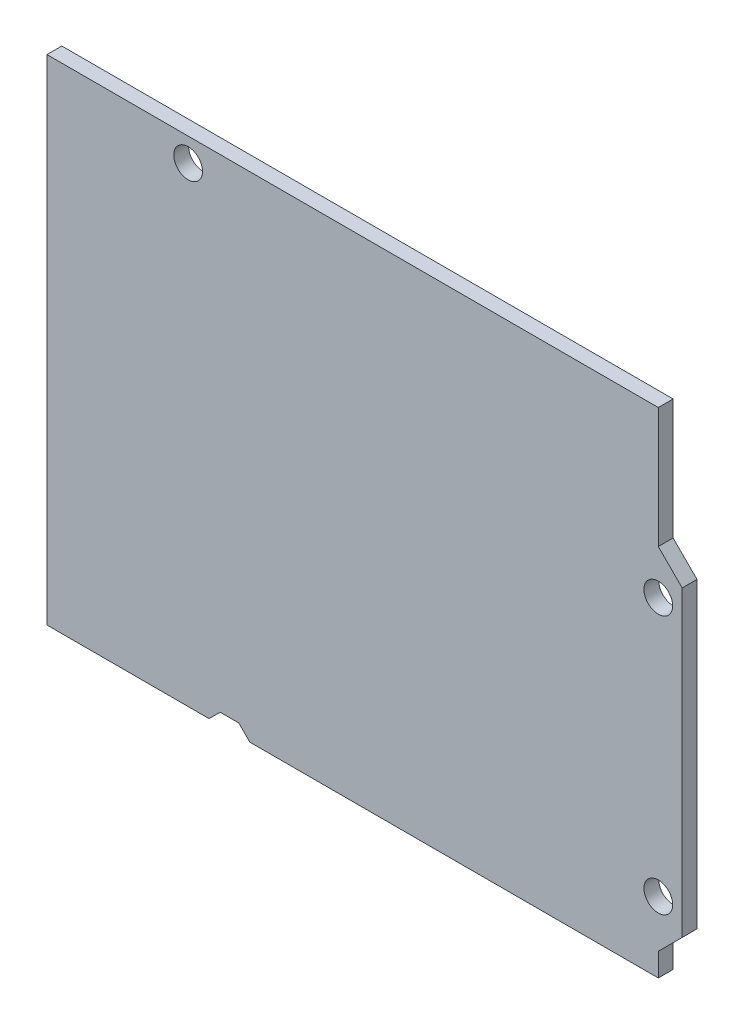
ISO-10303-21;
HEADER;
FILE_DESCRIPTION(('STEP AP214'),'2;1');
FILE_NAME('part.step','',(''),(''),'','','');
FILE_SCHEMA(('AUTOMOTIVE_DESIGN { 1 0 10303 214 1 1 1 1 }'));
ENDSEC;
DATA;
#1=APPLICATION_CONTEXT('core data for automotive mechanical design processes');
#2=APPLICATION_PROTOCOL_DEFINITION('international standard','automotive_design',2000,#1);
#3=PRODUCT_CONTEXT('',#1,'mechanical');
#4=PRODUCT('Part','Part','',(#3));
#5=PRODUCT_RELATED_PRODUCT_CATEGORY('part','',(#4));
#6=PRODUCT_DEFINITION_FORMATION('','',#4);
#7=PRODUCT_DEFINITION_CONTEXT('part definition',#1,'design');
#8=PRODUCT_DEFINITION('design','',#6,#7);
#9=PRODUCT_DEFINITION_SHAPE('','',#8);
#10=(LENGTH_UNIT() NAMED_UNIT(*) SI_UNIT(.MILLI.,.METRE.));
#11=(NAMED_UNIT(*) PLANE_ANGLE_UNIT() SI_UNIT($,.RADIAN.));
#12=(NAMED_UNIT(*) SI_UNIT($,.STERADIAN.) SOLID_ANGLE_UNIT());
#13=UNCERTAINTY_MEASURE_WITH_UNIT(LENGTH_MEASURE(1.E-05),#10,'distance_accuracy_value','');
#14=(GEOMETRIC_REPRESENTATION_CONTEXT(3) GLOBAL_UNCERTAINTY_ASSIGNED_CONTEXT((#13)) GLOBAL_UNIT_ASSIGNED_CONTEXT((#10,
#11,#12)) REPRESENTATION_CONTEXT('',''));
#15=CARTESIAN_POINT('',(0.,0.,0.));
#16=DIRECTION('',(0.,0.,1.));
#17=DIRECTION('',(1.,0.,0.));
#18=AXIS2_PLACEMENT_3D('',#15,#16,#17);
#19=CARTESIAN_POINT('',(0.,0.,1.6));
#20=DIRECTION('',(0.,0.,-1.));
#21=DIRECTION('',(-1.,0.,0.));
#22=AXIS2_PLACEMENT_3D('',#19,#20,#21);
#23=PLANE('',#22);
#24=CARTESIAN_POINT('',(66.,35.56,1.6));
#25=DIRECTION('',(0.,0.,1.));
#26=DIRECTION('',(1.,0.,0.));
#27=AXIS2_PLACEMENT_3D('',#24,#25,#26);
#28=CIRCLE('',#27,1.54999999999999);
#29=CARTESIAN_POINT('',(67.55,35.56,1.6));
#30=VERTEX_POINT('',#29);
#31=EDGE_CURVE('E288',#30,#30,#28,.T.);
#32=ORIENTED_EDGE('',*,*,#31,.F.);
#33=EDGE_LOOP('',(#32));
#34=FACE_BOUND('',#33,.T.);
#35=DIRECTION('',(1.,0.,0.));
#36=VECTOR('',#35,1.);
#37=CARTESIAN_POINT('',(17.5,0.,1.6));
#38=LINE('',#37,#36);
#39=CARTESIAN_POINT('',(0.,0.,1.6));
#40=VERTEX_POINT('',#39);
#41=CARTESIAN_POINT('',(17.5,0.,1.6));
#42=VERTEX_POINT('',#41);
#43=EDGE_CURVE('E178',#40,#42,#38,.T.);
#44=ORIENTED_EDGE('',*,*,#43,.T.);
#45=DIRECTION('',(0.707106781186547,0.707106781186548,0.));
#46=VECTOR('',#45,1.);
#47=CARTESIAN_POINT('',(18.7,1.2,1.6));
#48=LINE('',#47,#46);
#49=CARTESIAN_POINT('',(18.7,1.2,1.6));
#50=VERTEX_POINT('',#49);
#51=EDGE_CURVE('E106',#42,#50,#48,.T.);
#52=ORIENTED_EDGE('',*,*,#51,.T.);
#53=DIRECTION('',(1.,0.,0.));
#54=VECTOR('',#53,1.);
#55=CARTESIAN_POINT('',(20.7,1.2,1.6));
#56=LINE('',#55,#54);
#57=CARTESIAN_POINT('',(20.7,1.2,1.6));
#58=VERTEX_POINT('',#57);
#59=EDGE_CURVE('E205',#50,#58,#56,.T.);
#60=ORIENTED_EDGE('',*,*,#59,.T.);
#61=DIRECTION('',(0.707106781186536,-0.707106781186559,0.));
#62=VECTOR('',#61,1.);
#63=CARTESIAN_POINT('',(21.9,0.,1.6));
#64=LINE('',#63,#62);
#65=CARTESIAN_POINT('',(21.9,0.,1.6));
#66=VERTEX_POINT('',#65);
#67=EDGE_CURVE('E224',#58,#66,#64,.T.);
#68=ORIENTED_EDGE('',*,*,#67,.T.);
#69=DIRECTION('',(1.,0.,0.));
#70=VECTOR('',#69,1.);
#71=CARTESIAN_POINT('',(66.,0.,1.6));
#72=LINE('',#71,#70);
#73=CARTESIAN_POINT('',(66.,0.,1.6));
#74=VERTEX_POINT('',#73);
#75=EDGE_CURVE('E221',#66,#74,#72,.T.);
#76=ORIENTED_EDGE('',*,*,#75,.T.);
#77=DIRECTION('',(0.,1.,0.));
#78=VECTOR('',#77,1.);
#79=CARTESIAN_POINT('',(66.,2.5,1.6));
#80=LINE('',#79,#78);
#81=CARTESIAN_POINT('',(66.,2.5,1.6));
#82=VERTEX_POINT('',#81);
#83=EDGE_CURVE('E223',#74,#82,#80,.T.);
#84=ORIENTED_EDGE('',*,*,#83,.T.);
#85=DIRECTION('',(0.707106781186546,0.707106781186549,0.));
#86=VECTOR('',#85,1.);
#87=CARTESIAN_POINT('',(68.58,5.08,1.6));
#88=LINE('',#87,#86);
#89=CARTESIAN_POINT('',(68.58,5.08,1.6));
#90=VERTEX_POINT('',#89);
#91=EDGE_CURVE('E226',#82,#90,#88,.T.);
#92=ORIENTED_EDGE('',*,*,#91,.T.);
#93=DIRECTION('',(0.,1.,0.));
#94=VECTOR('',#93,1.);
#95=CARTESIAN_POINT('',(68.58,37.76,1.6));
#96=LINE('',#95,#94);
#97=CARTESIAN_POINT('',(68.58,37.76,1.6));
#98=VERTEX_POINT('',#97);
#99=EDGE_CURVE('E232',#90,#98,#96,.T.);
#100=ORIENTED_EDGE('',*,*,#99,.T.);
#101=DIRECTION('',(-0.707106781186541,0.707106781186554,0.));
#102=VECTOR('',#101,1.);
#103=CARTESIAN_POINT('',(66.,40.34,1.6));
#104=LINE('',#103,#102);
#105=CARTESIAN_POINT('',(66.,40.34,1.6));
#106=VERTEX_POINT('',#105);
#107=EDGE_CURVE('E137',#98,#106,#104,.T.);
#108=ORIENTED_EDGE('',*,*,#107,.T.);
#109=DIRECTION('',(0.,1.,0.));
#110=VECTOR('',#109,1.);
#111=CARTESIAN_POINT('',(66.,53.34,1.6));
#112=LINE('',#111,#110);
#113=CARTESIAN_POINT('',(66.,53.34,1.6));
#114=VERTEX_POINT('',#113);
#115=EDGE_CURVE('E131',#106,#114,#112,.T.);
#116=ORIENTED_EDGE('',*,*,#115,.T.);
#117=DIRECTION('',(-1.,0.,0.));
#118=VECTOR('',#117,1.);
#119=CARTESIAN_POINT('',(0.,53.34,1.6));
#120=LINE('',#119,#118);
#121=CARTESIAN_POINT('',(0.,53.34,1.6));
#122=VERTEX_POINT('',#121);
#123=EDGE_CURVE('E135',#114,#122,#120,.T.);
#124=ORIENTED_EDGE('',*,*,#123,.T.);
#125=DIRECTION('',(0.,-1.,0.));
#126=VECTOR('',#125,1.);
#127=CARTESIAN_POINT('',(0.,0.,1.6));
#128=LINE('',#127,#126);
#129=EDGE_CURVE('E51',#122,#40,#128,.T.);
#130=ORIENTED_EDGE('',*,*,#129,.T.);
#131=EDGE_LOOP('',(#44,#52,#60,#68,#76,#84,#92,#100,#108,#116,#124,#130));
#132=FACE_BOUND('',#131,.T.);
#133=CARTESIAN_POINT('',(15.24,50.8,1.6));
#134=DIRECTION('',(0.,0.,1.));
#135=DIRECTION('',(1.,0.,0.));
#136=AXIS2_PLACEMENT_3D('',#133,#134,#135);
#137=CIRCLE('',#136,1.55);
#138=CARTESIAN_POINT('',(16.79,50.8,1.6));
#139=VERTEX_POINT('',#138);
#140=EDGE_CURVE('E159',#139,#139,#137,.T.);
#141=ORIENTED_EDGE('',*,*,#140,.F.);
#142=EDGE_LOOP('',(#141));
#143=FACE_BOUND('',#142,.T.);
#144=CARTESIAN_POINT('',(66.,7.62,1.6));
#145=DIRECTION('',(0.,0.,1.));
#146=DIRECTION('',(1.,0.,0.));
#147=AXIS2_PLACEMENT_3D('',#144,#145,#146);
#148=CIRCLE('',#147,1.54999999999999);
#149=CARTESIAN_POINT('',(67.55,7.62,1.6));
#150=VERTEX_POINT('',#149);
#151=EDGE_CURVE('E279',#150,#150,#148,.T.);
#152=ORIENTED_EDGE('',*,*,#151,.F.);
#153=EDGE_LOOP('',(#152));
#154=FACE_BOUND('',#153,.T.);
#155=ADVANCED_FACE('F34',(#34,#132,#143,#154),#23,.F.);
#156=CARTESIAN_POINT('',(0.,0.,0.));
#157=DIRECTION('',(0.,0.,-1.));
#158=DIRECTION('',(-1.,0.,0.));
#159=AXIS2_PLACEMENT_3D('',#156,#157,#158);
#160=PLANE('',#159);
#161=CARTESIAN_POINT('',(66.,35.56,0.));
#162=DIRECTION('',(0.,0.,1.));
#163=DIRECTION('',(1.,0.,0.));
#164=AXIS2_PLACEMENT_3D('',#161,#162,#163);
#165=CIRCLE('',#164,1.54999999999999);
#166=CARTESIAN_POINT('',(67.55,35.56,0.));
#167=VERTEX_POINT('',#166);
#168=EDGE_CURVE('E285',#167,#167,#165,.T.);
#169=ORIENTED_EDGE('',*,*,#168,.T.);
#170=EDGE_LOOP('',(#169));
#171=FACE_BOUND('',#170,.T.);
#172=DIRECTION('',(1.,0.,0.));
#173=VECTOR('',#172,1.);
#174=CARTESIAN_POINT('',(17.5,0.,0.));
#175=LINE('',#174,#173);
#176=CARTESIAN_POINT('',(0.,0.,0.));
#177=VERTEX_POINT('',#176);
#178=CARTESIAN_POINT('',(17.5,0.,0.));
#179=VERTEX_POINT('',#178);
#180=EDGE_CURVE('E155',#177,#179,#175,.T.);
#181=ORIENTED_EDGE('',*,*,#180,.F.);
#182=DIRECTION('',(0.,-1.,0.));
#183=VECTOR('',#182,1.);
#184=CARTESIAN_POINT('',(0.,0.,0.));
#185=LINE('',#184,#183);
#186=CARTESIAN_POINT('',(0.,53.34,0.));
#187=VERTEX_POINT('',#186);
#188=EDGE_CURVE('E98',#187,#177,#185,.T.);
#189=ORIENTED_EDGE('',*,*,#188,.F.);
#190=DIRECTION('',(-1.,0.,0.));
#191=VECTOR('',#190,1.);
#192=CARTESIAN_POINT('',(0.,53.34,0.));
#193=LINE('',#192,#191);
#194=CARTESIAN_POINT('',(66.,53.34,0.));
#195=VERTEX_POINT('',#194);
#196=EDGE_CURVE('E92',#195,#187,#193,.T.);
#197=ORIENTED_EDGE('',*,*,#196,.F.);
#198=DIRECTION('',(0.,1.,0.));
#199=VECTOR('',#198,1.);
#200=CARTESIAN_POINT('',(66.,53.34,0.));
#201=LINE('',#200,#199);
#202=CARTESIAN_POINT('',(66.,40.34,0.));
#203=VERTEX_POINT('',#202);
#204=EDGE_CURVE('E145',#203,#195,#201,.T.);
#205=ORIENTED_EDGE('',*,*,#204,.F.);
#206=DIRECTION('',(-0.707106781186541,0.707106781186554,0.));
#207=VECTOR('',#206,1.);
#208=CARTESIAN_POINT('',(66.,40.34,0.));
#209=LINE('',#208,#207);
#210=CARTESIAN_POINT('',(68.58,37.76,0.));
#211=VERTEX_POINT('',#210);
#212=EDGE_CURVE('E173',#211,#203,#209,.T.);
#213=ORIENTED_EDGE('',*,*,#212,.F.);
#214=DIRECTION('',(0.,1.,0.));
#215=VECTOR('',#214,1.);
#216=CARTESIAN_POINT('',(68.58,37.76,0.));
#217=LINE('',#216,#215);
#218=CARTESIAN_POINT('',(68.58,5.08,0.));
#219=VERTEX_POINT('',#218);
#220=EDGE_CURVE('E171',#219,#211,#217,.T.);
#221=ORIENTED_EDGE('',*,*,#220,.F.);
#222=DIRECTION('',(0.707106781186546,0.707106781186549,0.));
#223=VECTOR('',#222,1.);
#224=CARTESIAN_POINT('',(68.58,5.08,0.));
#225=LINE('',#224,#223);
#226=CARTESIAN_POINT('',(66.,2.5,0.));
#227=VERTEX_POINT('',#226);
#228=EDGE_CURVE('E169',#227,#219,#225,.T.);
#229=ORIENTED_EDGE('',*,*,#228,.F.);
#230=DIRECTION('',(0.,1.,0.));
#231=VECTOR('',#230,1.);
#232=CARTESIAN_POINT('',(66.,2.5,0.));
#233=LINE('',#232,#231);
#234=CARTESIAN_POINT('',(66.,0.,0.));
#235=VERTEX_POINT('',#234);
#236=EDGE_CURVE('E167',#235,#227,#233,.T.);
#237=ORIENTED_EDGE('',*,*,#236,.F.);
#238=DIRECTION('',(1.,0.,0.));
#239=VECTOR('',#238,1.);
#240=CARTESIAN_POINT('',(66.,0.,0.));
#241=LINE('',#240,#239);
#242=CARTESIAN_POINT('',(21.9,0.,0.));
#243=VERTEX_POINT('',#242);
#244=EDGE_CURVE('E165',#243,#235,#241,.T.);
#245=ORIENTED_EDGE('',*,*,#244,.F.);
#246=DIRECTION('',(0.707106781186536,-0.707106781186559,0.));
#247=VECTOR('',#246,1.);
#248=CARTESIAN_POINT('',(21.9,0.,0.));
#249=LINE('',#248,#247);
#250=CARTESIAN_POINT('',(20.7,1.2,0.));
#251=VERTEX_POINT('',#250);
#252=EDGE_CURVE('E163',#251,#243,#249,.T.);
#253=ORIENTED_EDGE('',*,*,#252,.F.);
#254=DIRECTION('',(1.,0.,0.));
#255=VECTOR('',#254,1.);
#256=CARTESIAN_POINT('',(20.7,1.2,0.));
#257=LINE('',#256,#255);
#258=CARTESIAN_POINT('',(18.7,1.2,0.));
#259=VERTEX_POINT('',#258);
#260=EDGE_CURVE('E161',#259,#251,#257,.T.);
#261=ORIENTED_EDGE('',*,*,#260,.F.);
#262=DIRECTION('',(0.707106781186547,0.707106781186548,0.));
#263=VECTOR('',#262,1.);
#264=CARTESIAN_POINT('',(18.7,1.2,0.));
#265=LINE('',#264,#263);
#266=EDGE_CURVE('E158',#179,#259,#265,.T.);
#267=ORIENTED_EDGE('',*,*,#266,.F.);
#268=EDGE_LOOP('',(#181,#189,#197,#205,#213,#221,#229,#237,#245,#253,#261,#267));
#269=FACE_BOUND('',#268,.T.);
#270=CARTESIAN_POINT('',(15.24,50.8,0.));
#271=DIRECTION('',(0.,0.,1.));
#272=DIRECTION('',(1.,0.,0.));
#273=AXIS2_PLACEMENT_3D('',#270,#271,#272);
#274=CIRCLE('',#273,1.55);
#275=CARTESIAN_POINT('',(16.79,50.8,0.));
#276=VERTEX_POINT('',#275);
#277=EDGE_CURVE('E291',#276,#276,#274,.T.);
#278=ORIENTED_EDGE('',*,*,#277,.T.);
#279=EDGE_LOOP('',(#278));
#280=FACE_BOUND('',#279,.T.);
#281=CARTESIAN_POINT('',(66.,7.62,0.));
#282=DIRECTION('',(0.,0.,1.));
#283=DIRECTION('',(1.,0.,0.));
#284=AXIS2_PLACEMENT_3D('',#281,#282,#283);
#285=CIRCLE('',#284,1.54999999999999);
#286=CARTESIAN_POINT('',(67.55,7.62,0.));
#287=VERTEX_POINT('',#286);
#288=EDGE_CURVE('E282',#287,#287,#285,.T.);
#289=ORIENTED_EDGE('',*,*,#288,.T.);
#290=EDGE_LOOP('',(#289));
#291=FACE_BOUND('',#290,.T.);
#292=ADVANCED_FACE('F209',(#171,#269,#280,#291),#160,.T.);
#293=CARTESIAN_POINT('',(17.5,0.,1.6));
#294=DIRECTION('',(0.,1.,0.));
#295=DIRECTION('',(0.,0.,1.));
#296=AXIS2_PLACEMENT_3D('',#293,#294,#295);
#297=PLANE('',#296);
#298=ORIENTED_EDGE('',*,*,#180,.T.);
#299=DIRECTION('',(0.,0.,-1.));
#300=VECTOR('',#299,1.);
#301=CARTESIAN_POINT('',(17.5,0.,1.6));
#302=LINE('',#301,#300);
#303=EDGE_CURVE('E11',#42,#179,#302,.T.);
#304=ORIENTED_EDGE('',*,*,#303,.F.);
#305=ORIENTED_EDGE('',*,*,#43,.F.);
#306=DIRECTION('',(0.,0.,-1.));
#307=VECTOR('',#306,1.);
#308=CARTESIAN_POINT('',(0.,0.,1.6));
#309=LINE('',#308,#307);
#310=EDGE_CURVE('E151',#40,#177,#309,.T.);
#311=ORIENTED_EDGE('',*,*,#310,.T.);
#312=EDGE_LOOP('',(#298,#304,#305,#311));
#313=FACE_BOUND('',#312,.T.);
#314=ADVANCED_FACE('F36',(#313),#297,.F.);
#315=CARTESIAN_POINT('',(18.7,1.2,1.6));
#316=DIRECTION('',(-0.707106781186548,0.707106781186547,0.));
#317=DIRECTION('',(-0.707106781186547,-0.707106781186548,0.));
#318=AXIS2_PLACEMENT_3D('',#315,#316,#317);
#319=PLANE('',#318);
#320=ORIENTED_EDGE('',*,*,#266,.T.);
#321=DIRECTION('',(0.,0.,-1.));
#322=VECTOR('',#321,1.);
#323=CARTESIAN_POINT('',(18.7,1.2,1.6));
#324=LINE('',#323,#322);
#325=EDGE_CURVE('E43',#50,#259,#324,.T.);
#326=ORIENTED_EDGE('',*,*,#325,.F.);
#327=ORIENTED_EDGE('',*,*,#51,.F.);
#328=ORIENTED_EDGE('',*,*,#303,.T.);
#329=EDGE_LOOP('',(#320,#326,#327,#328));
#330=FACE_BOUND('',#329,.T.);
#331=ADVANCED_FACE('F392',(#330),#319,.F.);
#332=CARTESIAN_POINT('',(20.7,1.2,1.6));
#333=DIRECTION('',(0.,1.,0.));
#334=DIRECTION('',(0.,0.,1.));
#335=AXIS2_PLACEMENT_3D('',#332,#333,#334);
#336=PLANE('',#335);
#337=ORIENTED_EDGE('',*,*,#260,.T.);
#338=DIRECTION('',(0.,0.,-1.));
#339=VECTOR('',#338,1.);
#340=CARTESIAN_POINT('',(20.7,1.2,1.6));
#341=LINE('',#340,#339);
#342=EDGE_CURVE('E197',#58,#251,#341,.T.);
#343=ORIENTED_EDGE('',*,*,#342,.F.);
#344=ORIENTED_EDGE('',*,*,#59,.F.);
#345=ORIENTED_EDGE('',*,*,#325,.T.);
#346=EDGE_LOOP('',(#337,#343,#344,#345));
#347=FACE_BOUND('',#346,.T.);
#348=ADVANCED_FACE('F203',(#347),#336,.F.);
#349=CARTESIAN_POINT('',(21.9,0.,1.6));
#350=DIRECTION('',(0.707106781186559,0.707106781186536,0.));
#351=DIRECTION('',(-0.707106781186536,0.707106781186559,0.));
#352=AXIS2_PLACEMENT_3D('',#349,#350,#351);
#353=PLANE('',#352);
#354=ORIENTED_EDGE('',*,*,#252,.T.);
#355=DIRECTION('',(0.,0.,-1.));
#356=VECTOR('',#355,1.);
#357=CARTESIAN_POINT('',(21.9,0.,1.6));
#358=LINE('',#357,#356);
#359=EDGE_CURVE('E194',#66,#243,#358,.T.);
#360=ORIENTED_EDGE('',*,*,#359,.F.);
#361=ORIENTED_EDGE('',*,*,#67,.F.);
#362=ORIENTED_EDGE('',*,*,#342,.T.);
#363=EDGE_LOOP('',(#354,#360,#361,#362));
#364=FACE_BOUND('',#363,.T.);
#365=ADVANCED_FACE('F215',(#364),#353,.F.);
#366=CARTESIAN_POINT('',(66.,0.,1.6));
#367=DIRECTION('',(0.,1.,0.));
#368=DIRECTION('',(-1.,0.,0.));
#369=AXIS2_PLACEMENT_3D('',#366,#367,#368);
#370=PLANE('',#369);
#371=ORIENTED_EDGE('',*,*,#244,.T.);
#372=DIRECTION('',(0.,0.,-1.));
#373=VECTOR('',#372,1.);
#374=CARTESIAN_POINT('',(66.,0.,1.6));
#375=LINE('',#374,#373);
#376=EDGE_CURVE('E191',#74,#235,#375,.T.);
#377=ORIENTED_EDGE('',*,*,#376,.F.);
#378=ORIENTED_EDGE('',*,*,#75,.F.);
#379=ORIENTED_EDGE('',*,*,#359,.T.);
#380=EDGE_LOOP('',(#371,#377,#378,#379));
#381=FACE_BOUND('',#380,.T.);
#382=ADVANCED_FACE('F219',(#381),#370,.F.);
#383=CARTESIAN_POINT('',(66.,2.5,1.6));
#384=DIRECTION('',(-1.,0.,0.));
#385=DIRECTION('',(0.,-1.,0.));
#386=AXIS2_PLACEMENT_3D('',#383,#384,#385);
#387=PLANE('',#386);
#388=ORIENTED_EDGE('',*,*,#236,.T.);
#389=DIRECTION('',(0.,0.,-1.));
#390=VECTOR('',#389,1.);
#391=CARTESIAN_POINT('',(66.,2.5,1.6));
#392=LINE('',#391,#390);
#393=EDGE_CURVE('E188',#82,#227,#392,.T.);
#394=ORIENTED_EDGE('',*,*,#393,.F.);
#395=ORIENTED_EDGE('',*,*,#83,.F.);
#396=ORIENTED_EDGE('',*,*,#376,.T.);
#397=EDGE_LOOP('',(#388,#394,#395,#396));
#398=FACE_BOUND('',#397,.T.);
#399=ADVANCED_FACE('F357',(#398),#387,.F.);
#400=CARTESIAN_POINT('',(68.58,5.08,1.6));
#401=DIRECTION('',(-0.707106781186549,0.707106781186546,0.));
#402=DIRECTION('',(-0.707106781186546,-0.707106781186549,0.));
#403=AXIS2_PLACEMENT_3D('',#400,#401,#402);
#404=PLANE('',#403);
#405=ORIENTED_EDGE('',*,*,#228,.T.);
#406=DIRECTION('',(0.,0.,-1.));
#407=VECTOR('',#406,1.);
#408=CARTESIAN_POINT('',(68.58,5.08,1.6));
#409=LINE('',#408,#407);
#410=EDGE_CURVE('E185',#90,#219,#409,.T.);
#411=ORIENTED_EDGE('',*,*,#410,.F.);
#412=ORIENTED_EDGE('',*,*,#91,.F.);
#413=ORIENTED_EDGE('',*,*,#393,.T.);
#414=EDGE_LOOP('',(#405,#411,#412,#413));
#415=FACE_BOUND('',#414,.T.);
#416=ADVANCED_FACE('F348',(#415),#404,.F.);
#417=CARTESIAN_POINT('',(68.58,37.76,1.6));
#418=DIRECTION('',(-1.,0.,0.));
#419=DIRECTION('',(0.,-1.,0.));
#420=AXIS2_PLACEMENT_3D('',#417,#418,#419);
#421=PLANE('',#420);
#422=ORIENTED_EDGE('',*,*,#220,.T.);
#423=DIRECTION('',(0.,0.,-1.));
#424=VECTOR('',#423,1.);
#425=CARTESIAN_POINT('',(68.58,37.76,1.6));
#426=LINE('',#425,#424);
#427=EDGE_CURVE('E182',#98,#211,#426,.T.);
#428=ORIENTED_EDGE('',*,*,#427,.F.);
#429=ORIENTED_EDGE('',*,*,#99,.F.);
#430=ORIENTED_EDGE('',*,*,#410,.T.);
#431=EDGE_LOOP('',(#422,#428,#429,#430));
#432=FACE_BOUND('',#431,.T.);
#433=ADVANCED_FACE('F238',(#432),#421,.F.);
#434=CARTESIAN_POINT('',(66.,40.34,1.6));
#435=DIRECTION('',(-0.707106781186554,-0.707106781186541,0.));
#436=DIRECTION('',(0.707106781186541,-0.707106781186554,0.));
#437=AXIS2_PLACEMENT_3D('',#434,#435,#436);
#438=PLANE('',#437);
#439=ORIENTED_EDGE('',*,*,#212,.T.);
#440=DIRECTION('',(0.,0.,-1.));
#441=VECTOR('',#440,1.);
#442=CARTESIAN_POINT('',(66.,40.34,1.6));
#443=LINE('',#442,#441);
#444=EDGE_CURVE('E146',#106,#203,#443,.T.);
#445=ORIENTED_EDGE('',*,*,#444,.F.);
#446=ORIENTED_EDGE('',*,*,#107,.F.);
#447=ORIENTED_EDGE('',*,*,#427,.T.);
#448=EDGE_LOOP('',(#439,#445,#446,#447));
#449=FACE_BOUND('',#448,.T.);
#450=ADVANCED_FACE('F242',(#449),#438,.F.);
#451=CARTESIAN_POINT('',(66.,53.34,1.6));
#452=DIRECTION('',(-1.,0.,0.));
#453=DIRECTION('',(0.,-1.,0.));
#454=AXIS2_PLACEMENT_3D('',#451,#452,#453);
#455=PLANE('',#454);
#456=ORIENTED_EDGE('',*,*,#204,.T.);
#457=DIRECTION('',(0.,0.,-1.));
#458=VECTOR('',#457,1.);
#459=CARTESIAN_POINT('',(66.,53.34,1.6));
#460=LINE('',#459,#458);
#461=EDGE_CURVE('E142',#114,#195,#460,.T.);
#462=ORIENTED_EDGE('',*,*,#461,.F.);
#463=ORIENTED_EDGE('',*,*,#115,.F.);
#464=ORIENTED_EDGE('',*,*,#444,.T.);
#465=EDGE_LOOP('',(#456,#462,#463,#464));
#466=FACE_BOUND('',#465,.T.);
#467=ADVANCED_FACE('F143',(#466),#455,.F.);
#468=CARTESIAN_POINT('',(0.,53.34,1.6));
#469=DIRECTION('',(0.,-1.,0.));
#470=DIRECTION('',(0.,0.,-1.));
#471=AXIS2_PLACEMENT_3D('',#468,#469,#470);
#472=PLANE('',#471);
#473=ORIENTED_EDGE('',*,*,#196,.T.);
#474=DIRECTION('',(0.,0.,-1.));
#475=VECTOR('',#474,1.);
#476=CARTESIAN_POINT('',(0.,53.34,1.6));
#477=LINE('',#476,#475);
#478=EDGE_CURVE('E147',#122,#187,#477,.T.);
#479=ORIENTED_EDGE('',*,*,#478,.F.);
#480=ORIENTED_EDGE('',*,*,#123,.F.);
#481=ORIENTED_EDGE('',*,*,#461,.T.);
#482=EDGE_LOOP('',(#473,#479,#480,#481));
#483=FACE_BOUND('',#482,.T.);
#484=ADVANCED_FACE('F149',(#483),#472,.F.);
#485=CARTESIAN_POINT('',(0.,0.,1.6));
#486=DIRECTION('',(1.,0.,0.));
#487=DIRECTION('',(0.,0.,-1.));
#488=AXIS2_PLACEMENT_3D('',#485,#486,#487);
#489=PLANE('',#488);
#490=ORIENTED_EDGE('',*,*,#188,.T.);
#491=ORIENTED_EDGE('',*,*,#310,.F.);
#492=ORIENTED_EDGE('',*,*,#129,.F.);
#493=ORIENTED_EDGE('',*,*,#478,.T.);
#494=EDGE_LOOP('',(#490,#491,#492,#493));
#495=FACE_BOUND('',#494,.T.);
#496=ADVANCED_FACE('F246',(#495),#489,.F.);
#497=CARTESIAN_POINT('',(15.24,50.8,1.6));
#498=DIRECTION('',(0.,0.,-1.));
#499=DIRECTION('',(-1.,0.,0.));
#500=AXIS2_PLACEMENT_3D('',#497,#498,#499);
#501=CYLINDRICAL_SURFACE('',#500,1.55);
#502=ORIENTED_EDGE('',*,*,#140,.T.);
#503=EDGE_LOOP('',(#502));
#504=FACE_BOUND('',#503,.T.);
#505=ORIENTED_EDGE('',*,*,#277,.F.);
#506=EDGE_LOOP('',(#505));
#507=FACE_BOUND('',#506,.T.);
#508=ADVANCED_FACE('F248',(#504,#507),#501,.F.);
#509=CARTESIAN_POINT('',(66.,35.56,1.6));
#510=DIRECTION('',(0.,0.,-1.));
#511=DIRECTION('',(-1.,0.,0.));
#512=AXIS2_PLACEMENT_3D('',#509,#510,#511);
#513=CYLINDRICAL_SURFACE('',#512,1.54999999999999);
#514=ORIENTED_EDGE('',*,*,#31,.T.);
#515=EDGE_LOOP('',(#514));
#516=FACE_BOUND('',#515,.T.);
#517=ORIENTED_EDGE('',*,*,#168,.F.);
#518=EDGE_LOOP('',(#517));
#519=FACE_BOUND('',#518,.T.);
#520=ADVANCED_FACE('F254',(#516,#519),#513,.F.);
#521=CARTESIAN_POINT('',(66.,7.62,1.6));
#522=DIRECTION('',(0.,0.,-1.));
#523=DIRECTION('',(-1.,0.,0.));
#524=AXIS2_PLACEMENT_3D('',#521,#522,#523);
#525=CYLINDRICAL_SURFACE('',#524,1.54999999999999);
#526=ORIENTED_EDGE('',*,*,#151,.T.);
#527=EDGE_LOOP('',(#526));
#528=FACE_BOUND('',#527,.T.);
#529=ORIENTED_EDGE('',*,*,#288,.F.);
#530=EDGE_LOOP('',(#529));
#531=FACE_BOUND('',#530,.T.);
#532=ADVANCED_FACE('F270',(#528,#531),#525,.F.);
#533=CLOSED_SHELL('',(#155,#292,#314,#331,#348,#365,#382,#399,#416,#433,#450,#467,#484,#496,
#508,#520,#532));
#534=MANIFOLD_SOLID_BREP('B2',#533);
#535=ADVANCED_BREP_SHAPE_REPRESENTATION('',(#18,#534),#14);
#536=SHAPE_DEFINITION_REPRESENTATION(#9,#535);
ENDSEC;
END-ISO-10303-21;
